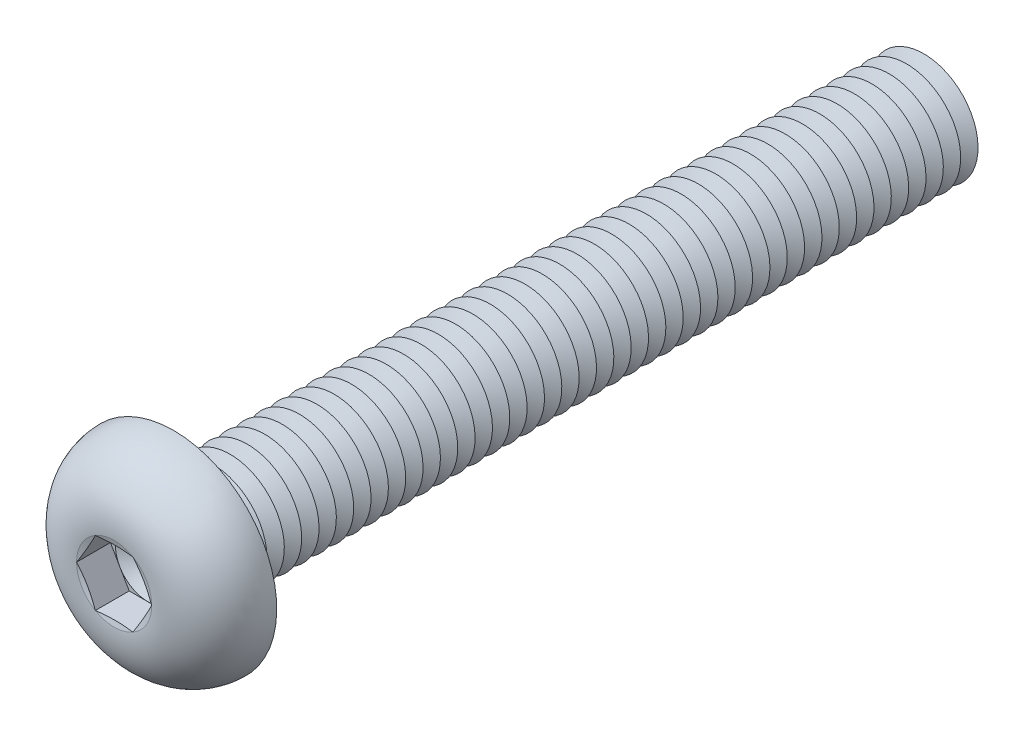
from build123d import *

# Parameters (mm, degrees)
FILLET1_R          = 0.4
LPATTERN1_COUNT    = 43
LPATTERN1_PITCH    = 0.8
CUT_EXTRUDE1_DEPTH = 1.56


with BuildPart() as part:
    # Sketch1 → Revolve1 (revolve)
    with BuildSketch(Plane(origin=(0, 0, 0), x_dir=(0, 0, -1), z_dir=(1, 0, 0))):
        with BuildLine():
            Line((0, 2.5), (0, 4.75))
            ThreePointArc((0, 4.75), (-2.041477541, 3.848329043), (-2.75, 1.73205))
            Line((-2.75, 1.73205), (-2.517949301, 0.866025))
            Line((-2.517949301, 0.866025), (-2.75, 0.866025))
            Line((-2.75, 0.866025), (-2.75, 0))
            Line((-2.75, 0), (35, 0))
            Line((35, 0), (35, 2.5))
            Line((35, 2.5), (0, 2.5))
        make_face()
    revolve(axis=Axis((0, 0, -35), (0, 0, 1)))

    # Fillet1
    fillet1_edges = [part.edges().sort_by_distance(p)[0] for p in [
        (0, -2.5, 0),
    ]]
    fillet(fillet1_edges, radius=FILLET1_R)

    # Sketch2 → Cut-Revolve1 (revolve, cut)
    with BuildSketch(Plane(origin=(0, 0, 0), x_dir=(0, 0, -1), z_dir=(1, 0, 0))):
        Polygon((34.6, 2.5), (35.4, 2.5), (35, 1.807179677), align=None)
    cut_revolve1 = revolve(axis=Axis((0, 0, -35), (0, 0, -1)), mode=Mode.SUBTRACT)

    # LPattern1: Cut-Revolve1 ×43
    with Locations(*[(0, 0, i * LPATTERN1_PITCH) for i in range(1, LPATTERN1_COUNT)]):
        add(cut_revolve1, mode=Mode.SUBTRACT)

    # Sketch3 → Cut-Extrude1 (cut)
    with BuildSketch(Plane.XY.offset(2.75)):
        Polygon((0.866025, 1.499999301), (-0.866025, 1.499999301), (-1.73205, 0), (-0.866025, -1.499999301), (0.866025, -1.499999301), (1.73205, 0), align=None)
    extrude(amount=-CUT_EXTRUDE1_DEPTH, mode=Mode.SUBTRACT)

    # Cut-Extrude2 cone 1 section (on through the dimple's axis) → Cut-Extrude2 (revolve, cut)
    with BuildSketch(Plane(origin=(0, 0, 1.19), x_dir=(0, -1, 0), z_dir=(1, 0, 0))):
        Polygon((0, 0), (1.499999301, 0), (0, 0.866025), align=None)
    revolve(axis=Axis((0, 0, 1.19), (0, 0, -1)), mode=Mode.SUBTRACT)


solid = part.part
